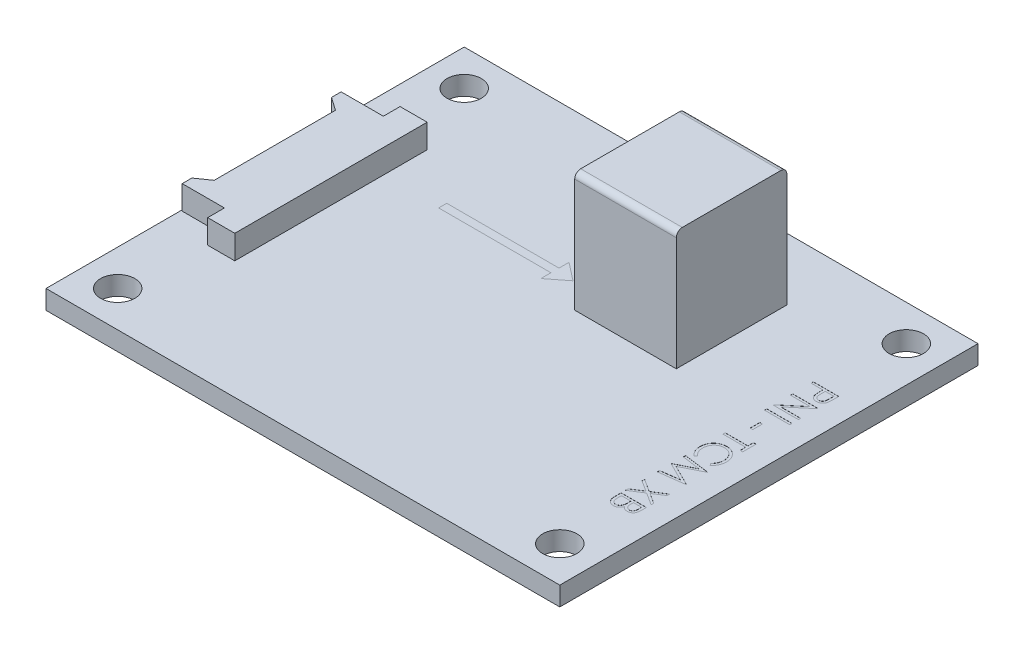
from build123d import *

# Parameters (mm, degrees)
SKETCH1_W           = 43
SKETCH1_H           = 35
SKETCH1_R           = 1.435
BOSS_EXTRUDE1_DEPTH = 1.588
SKETCH7_W           = 8.5
SKETCH7_H           = 9.25
BOSS_EXTRUDE4_DEPTH = 10
FILLET1_R           = 0.5
BOSS_EXTRUDE5_DEPTH = 2
SKETCH8_W           = 2.116666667
SKETCH8_H           = 0.189957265
SKETCH8_W_2         = 0.217094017
SKETCH8_H_2         = 0.814102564
CUT_EXTRUDE2_DEPTH  = 0.01


with BuildPart() as part:
    # Sketch1 → Boss-Extrude1 (new body)
    with BuildSketch(Plane(origin=(0, 0, 0), x_dir=(1, 0, 0), z_dir=(0, 1, 0))):
        Rectangle(SKETCH1_W, SKETCH1_H)
        with Locations(Location((-18.5, 14.5, 0), (0, 0, 270))):
            Circle(SKETCH1_R, mode=Mode.SUBTRACT)
        with Locations(Location((18.5, -14.5, 0), (0, 0, 270))):
            Circle(SKETCH1_R, mode=Mode.SUBTRACT)
        with Locations(Location((-18.5, -14.5, 0), (0, 0, 270))):
            Circle(SKETCH1_R, mode=Mode.SUBTRACT)
        with Locations(Location((18.5, 14.5, 0), (0, 0, 270))):
            Circle(SKETCH1_R, mode=Mode.SUBTRACT)
    extrude(amount=BOSS_EXTRUDE1_DEPTH)

    # Sketch7 → Boss-Extrude4 (add)
    with BuildSketch(Plane(origin=(0, 1.588, 0), x_dir=(1, 0, 0), z_dir=(0, 1, 0))):
        with Locations((6.45, 7.675)):
            Rectangle(SKETCH7_W, SKETCH7_H)
    extrude(amount=BOSS_EXTRUDE4_DEPTH)

    # Fillet1
    fillet1_edges = [part.edges().sort_by_distance(p)[0] for p in [
        (6.45, 11.588, -3.05),
        (6.45, 11.588, -12.3),
    ]]
    fillet(fillet1_edges, radius=FILLET1_R)

    # Sketch9 → Boss-Extrude5 (add)
    with BuildSketch(Plane(origin=(0, 1.588, 0), x_dir=(1, 0, 0), z_dir=(0, 1, 0))):
        Polygon((-15.6, 8.5), (-17.866849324, 8.5), (-17.866849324, 7.1), (-21.4, 7.1), (-21.4, 6.295102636), (-20.3, 5.524195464), (-20.3, -4.624195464), (-21.4, -5.395102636), (-21.4, -6.2), (-17.866849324, -6.2), (-17.866849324, -7.6), (-15.6, -7.6), align=None)
    extrude(amount=BOSS_EXTRUDE5_DEPTH)

    # Sketch8 → Cut-Extrude2 (cut)
    # profile 1 of 9: a face of its own
    with BuildSketch(Plane(origin=(0, 1.588, 0), x_dir=(1, 0, 0), z_dir=(0, 1, 0))):
        with BuildLine():
            Line((19.497367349, 7.842992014), (19.497367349, 7.427884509))
            add(Edge.make_bspline(
                [(19.497367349, 7.427884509), (19.497335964, 7.399333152), (19.497275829, 7.344627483), (19.495452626, 7.266180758), (19.493017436, 7.194933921), (19.489641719, 7.131040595), (19.485652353, 7.074304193), (19.480057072, 7.024981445), (19.474214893, 6.982684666), (19.468275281, 6.957341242), (19.465566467, 6.945783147)],
                knots=[0, 0, 0, 0, 1.415646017, 2.712440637, 3.8905458, 4.950247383, 5.884950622, 6.709939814, 7.411656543, 8, 8, 8, 8], degree=3))
            add(Edge.make_bspline(
                [(19.465566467, 6.945783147), (19.4615618, 6.931151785), (19.45364683, 6.90223383), (19.437793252, 6.860565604), (19.418997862, 6.82091928), (19.397567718, 6.78316991), (19.372626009, 6.747740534), (19.344961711, 6.714177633), (19.314590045, 6.682288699), (19.280922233, 6.65315699), (19.245199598, 6.626337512), (19.206626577, 6.603330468), (19.166042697, 6.583869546), (19.123032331, 6.567975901), (19.077856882, 6.555890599), (19.030384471, 6.546961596), (18.980778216, 6.54124871), (18.946874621, 6.540704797), (18.929615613, 6.540427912)],
                knots=[0, 0, 0, 0, 0.999487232, 1.975422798, 2.933948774, 3.889618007, 4.832992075, 5.786114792, 6.754729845, 7.731954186, 8.717668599, 9.695514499, 10.68728626, 11.680675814, 12.71351902, 13.766008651, 14.862761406, 16, 16, 16, 16], degree=3))
            add(Edge.make_bspline(
                [(18.929615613, 6.540427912), (18.912211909, 6.540682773), (18.878160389, 6.541181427), (18.828344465, 6.547166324), (18.780738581, 6.555227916), (18.735448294, 6.567623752), (18.692742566, 6.583858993), (18.651968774, 6.602904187), (18.613820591, 6.625875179), (18.578159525, 6.652269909), (18.544952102, 6.681632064), (18.514438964, 6.713837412), (18.486798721, 6.748755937), (18.461969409, 6.786276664), (18.440526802, 6.826765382), (18.421321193, 6.869608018), (18.405191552, 6.915176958), (18.396706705, 6.946710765), (18.392392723, 6.962743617)],
                knots=[0, 0, 0, 0, 1.121902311, 2.195077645, 3.232258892, 4.234102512, 5.217864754, 6.176164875, 7.132989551, 8.084763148, 9.034132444, 9.988522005, 10.94243251, 11.903244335, 12.886203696, 13.894208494, 14.929344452, 16, 16, 16, 16], degree=3))
            add(Edge.make_bspline(
                [(18.392392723, 6.962743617), (18.389572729, 6.976004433), (18.38339255, 7.005066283), (18.37649315, 7.052928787), (18.37060422, 7.108654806), (18.36618877, 7.17216828), (18.362408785, 7.243412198), (18.359404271, 7.322425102), (18.35775336, 7.409362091), (18.357668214, 7.47000232), (18.357623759, 7.501662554)],
                knots=[0, 0, 0, 0, 0.601384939, 1.31797006, 2.144135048, 3.087295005, 4.142315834, 5.309527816, 6.595305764, 8, 8, 8, 8], degree=3))
            Line((18.357623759, 7.501662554), (18.357623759, 7.653034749))
            Line((18.357623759, 7.653034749), (17.380700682, 7.653034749))
            Line((17.380700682, 7.653034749), (17.380700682, 7.842992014))
            Line((17.380700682, 7.842992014), (19.497367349, 7.842992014))
        make_face()
        with BuildLine():
            Line((19.280273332, 7.653034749), (18.574717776, 7.653034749))
            Line((18.574717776, 7.653034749), (18.570053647, 7.282448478))
            add(Edge.make_bspline(
                [(18.570053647, 7.282448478), (18.570042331, 7.26435387), (18.570020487, 7.229422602), (18.572463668, 7.178824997), (18.57515866, 7.132002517), (18.579379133, 7.08885348), (18.584940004, 7.049707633), (18.590992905, 7.014062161), (18.599193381, 6.982438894), (18.610627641, 6.945382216), (18.629748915, 6.904229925), (18.658219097, 6.859757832), (18.69351304, 6.821458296), (18.733740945, 6.788536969), (18.778655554, 6.763023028), (18.826334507, 6.743833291), (18.876807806, 6.73265538), (18.911329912, 6.731147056), (18.928767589, 6.730385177)],
                knots=[0, 0, 0, 0, 1.160368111, 2.240066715, 3.248291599, 4.168343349, 5.019594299, 5.784185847, 6.485545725, 7.113397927, 8.269509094, 9.383373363, 10.487084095, 11.595623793, 12.704274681, 13.786671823, 14.88201193, 16, 16, 16, 16], degree=3))
            add(Edge.make_bspline(
                [(18.928767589, 6.730385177), (18.945783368, 6.731151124), (18.97960863, 6.732673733), (19.029205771, 6.743921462), (19.076378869, 6.762985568), (19.120740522, 6.788709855), (19.160803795, 6.820685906), (19.195301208, 6.858136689), (19.223410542, 6.900297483), (19.241428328, 6.939536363), (19.252447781, 6.974368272), (19.260154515, 7.004626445), (19.266308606, 7.038789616), (19.271291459, 7.076870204), (19.27555715, 7.118572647), (19.278451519, 7.164255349), (19.280145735, 7.213745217), (19.28022977, 7.248102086), (19.280273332, 7.26591202)],
                knots=[0, 0, 0, 0, 1.120550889, 2.227516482, 3.330715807, 4.461473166, 5.594337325, 6.694900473, 7.802844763, 8.919519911, 9.52614448, 10.208195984, 10.975273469, 11.811520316, 12.738076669, 13.736566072, 14.826679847, 16, 16, 16, 16], degree=3))
            Line((19.280273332, 7.26591202), (19.280273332, 7.653034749))
        make_face(mode=Mode.SUBTRACT)
    # profile 2 of 9: a face of its own
    with BuildSketch(Plane(origin=(0, 1.588, 0), x_dir=(1, 0, 0), z_dir=(0, 1, 0))):
        Polygon((17.380700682, 6.106239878), (19.497367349, 6.106239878), (19.497367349, 6.066382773), (17.831425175, 4.667992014), (19.497367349, 4.667992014), (19.497367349, 4.478034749), (17.380700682, 4.478034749), (17.380700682, 4.521283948), (19.04282675, 5.916282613), (17.380700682, 5.916282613), align=None)
    # profile 3 of 9: a face of its own
    with BuildSketch(Plane(origin=(0, 1.588, 0), x_dir=(1, 0, 0), z_dir=(0, 1, 0))):
        with Locations((18.439034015, 3.840321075)):
            Rectangle(SKETCH8_W, SKETCH8_H)
    # profile 4 of 9: a face of its own
    with BuildSketch(Plane(origin=(0, 1.588, 0), x_dir=(1, 0, 0), z_dir=(0, 1, 0))):
        with Locations((18.194803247, 2.252821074)):
            Rectangle(SKETCH8_W_2, SKETCH8_H_2)
    # profile 5 of 9: a face of its own
    with BuildSketch(Plane(origin=(0, 1.588, 0), x_dir=(1, 0, 0), z_dir=(0, 1, 0))):
        Polygon((19.280273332, 0.92312022), (19.497367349, 0.92312022), (19.497367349, -0.189486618), (19.280273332, -0.189486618), (19.280273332, 0.271838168), (17.380700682, 0.271838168), (17.380700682, 0.461795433), (19.280273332, 0.461795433), align=None)
    # profile 6 of 9: a face of its own
    with BuildSketch(Plane(origin=(0, 1.588, 0), x_dir=(1, 0, 0), z_dir=(0, 1, 0))):
        with BuildLine():
            Line((19.108972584, -2.523247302), (18.981769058, -2.357034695))
            add(Edge.make_bspline(
                [(18.981769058, -2.357034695), (18.995899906, -2.345177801), (19.023971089, -2.321623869), (19.063389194, -2.28372997), (19.100319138, -2.244238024), (19.134936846, -2.203163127), (19.166031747, -2.159765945), (19.195224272, -2.115097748), (19.221390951, -2.068411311), (19.253118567, -2.003851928), (19.286226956, -1.91939823), (19.313987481, -1.813084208), (19.331659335, -1.702103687), (19.333573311, -1.626388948), (19.334546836, -1.587877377)],
                knots=[0, 0, 0, 0, 0.757959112, 1.505699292, 2.245454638, 2.979532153, 3.711538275, 4.438200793, 5.171680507, 5.909471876, 7.393775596, 8.890124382, 10.418191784, 12, 12, 12, 12], degree=3))
            add(Edge.make_bspline(
                [(19.334546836, -1.587877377), (19.334301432, -1.566660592), (19.333812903, -1.524423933), (19.327413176, -1.461737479), (19.318314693, -1.400102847), (19.305142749, -1.339749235), (19.287994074, -1.280796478), (19.267883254, -1.222795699), (19.242857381, -1.166429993), (19.215219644, -1.111021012), (19.183994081, -1.05793794), (19.149945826, -1.007701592), (19.113409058, -0.960541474), (19.074478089, -0.916326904), (19.032669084, -0.87554279), (18.988473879, -0.837535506), (18.941360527, -0.802990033), (18.892212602, -0.771057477), (18.840957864, -0.742643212), (18.787918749, -0.71810612), (18.733298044, -0.697075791), (18.676983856, -0.680280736), (18.619197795, -0.667033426), (18.559817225, -0.657881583), (18.498957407, -0.651539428), (18.457707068, -0.651055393), (18.436913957, -0.650811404)],
                knots=[0, 0, 0, 0, 1.055000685, 2.100209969, 3.131349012, 4.153242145, 5.170189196, 6.184191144, 7.204341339, 8.235672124, 9.263040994, 10.265373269, 11.252624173, 12.22887325, 13.193405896, 14.155809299, 15.126090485, 16.097288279, 17.069732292, 18.038585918, 19.002221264, 19.978698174, 20.959418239, 21.948869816, 22.966084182, 24, 24, 24, 24], degree=3))
            add(Edge.make_bspline(
                [(18.436913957, -0.650811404), (18.405628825, -0.651574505), (18.344204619, -0.65307275), (18.254233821, -0.666406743), (18.168042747, -0.686669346), (18.086170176, -0.717037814), (18.00760655, -0.754484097), (17.933681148, -0.801801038), (17.863276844, -0.856602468), (17.798057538, -0.919663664), (17.73848019, -0.988851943), (17.686016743, -1.063085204), (17.642283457, -1.142178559), (17.605891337, -1.225258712), (17.57791703, -1.31296498), (17.558223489, -1.405139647), (17.545377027, -1.501582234), (17.54414713, -1.567482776), (17.543521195, -1.601021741)],
                knots=[0, 0, 0, 0, 1.029171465, 2.020641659, 2.987623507, 3.938342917, 4.889210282, 5.84687017, 6.821220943, 7.821438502, 8.827599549, 9.822697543, 10.807740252, 11.797342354, 12.80366471, 13.83203677, 14.896651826, 16, 16, 16, 16], degree=3))
            add(Edge.make_bspline(
                [(17.543521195, -1.601021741), (17.544542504, -1.63797432), (17.546552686, -1.710705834), (17.563582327, -1.817366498), (17.591194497, -1.919471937), (17.629837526, -2.017027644), (17.680072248, -2.109758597), (17.740970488, -2.19780991), (17.813111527, -2.281255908), (17.868195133, -2.331433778), (17.896298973, -2.357034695)],
                knots=[0, 0, 0, 0, 1.028121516, 2.023589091, 2.998037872, 3.967518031, 4.937445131, 5.927275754, 6.942489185, 8, 8, 8, 8], degree=3))
            Line((17.896298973, -2.357034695), (17.770367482, -2.523247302))
            add(Edge.make_bspline(
                [(17.770367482, -2.523247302), (17.753108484, -2.509871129), (17.718673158, -2.483182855), (17.670128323, -2.439967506), (17.624464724, -2.394443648), (17.582060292, -2.346267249), (17.54202979, -2.296014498), (17.505715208, -2.24280022), (17.472010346, -2.187543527), (17.441556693, -2.129922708), (17.414251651, -2.070126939), (17.391199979, -2.008218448), (17.371057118, -1.944721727), (17.354595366, -1.8796048), (17.341726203, -1.812650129), (17.333128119, -1.744087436), (17.327236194, -1.673771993), (17.326699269, -1.626333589), (17.326427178, -1.602293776)],
                knots=[0, 0, 0, 0, 0.986756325, 1.968786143, 2.935506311, 3.899499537, 4.868307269, 5.8376204, 6.809456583, 7.792545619, 8.781780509, 9.778496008, 10.776623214, 11.79151764, 12.812666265, 13.856269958, 14.913646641, 16, 16, 16, 16], degree=3))
            add(Edge.make_bspline(
                [(17.326427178, -1.602293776), (17.326585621, -1.57952832), (17.326898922, -1.534512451), (17.331974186, -1.468049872), (17.33889855, -1.40334665), (17.349324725, -1.340587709), (17.361628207, -1.279430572), (17.378120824, -1.220429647), (17.396595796, -1.163004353), (17.418309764, -1.107385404), (17.442812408, -1.053525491), (17.470505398, -1.001598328), (17.501155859, -0.9516278), (17.534088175, -0.903122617), (17.570360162, -0.856799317), (17.609468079, -0.81225647), (17.651280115, -0.769244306), (17.681430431, -0.742633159), (17.696589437, -0.729253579)],
                knots=[0, 0, 0, 0, 1.114604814, 2.203992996, 3.262667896, 4.300477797, 5.318619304, 6.316056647, 7.298880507, 8.271930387, 9.238335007, 10.195173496, 11.151986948, 12.108099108, 13.064862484, 14.031167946, 15.010108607, 16, 16, 16, 16], degree=3))
            add(Edge.make_bspline(
                [(17.696589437, -0.729253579), (17.72292149, -0.707823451), (17.775267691, -0.66522192), (17.860107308, -0.61071734), (17.948685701, -0.564061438), (18.041468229, -0.526338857), (18.138246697, -0.496849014), (18.239069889, -0.476419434), (18.343843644, -0.46314394), (18.415106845, -0.461625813), (18.451330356, -0.460854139)],
                knots=[0, 0, 0, 0, 0.994628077, 1.977248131, 2.950237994, 3.925870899, 4.908910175, 5.911660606, 6.938484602, 8, 8, 8, 8], degree=3))
            add(Edge.make_bspline(
                [(18.451330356, -0.460854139), (18.489401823, -0.461798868), (18.564305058, -0.463657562), (18.674257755, -0.479318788), (18.77944863, -0.50481829), (18.880282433, -0.539931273), (18.97618223, -0.586254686), (19.067553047, -0.642332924), (19.154320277, -0.708713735), (19.235374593, -0.784563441), (19.30947975, -0.867763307), (19.374677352, -0.956854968), (19.428934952, -1.051671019), (19.47428981, -1.151165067), (19.509150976, -1.25608262), (19.533555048, -1.3661997), (19.548744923, -1.481309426), (19.550665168, -1.559845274), (19.551640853, -1.599749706)],
                knots=[0, 0, 0, 0, 1.032901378, 2.032168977, 3.007206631, 3.966850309, 4.924221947, 5.891988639, 6.871730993, 7.884084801, 8.900290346, 9.89161143, 10.874607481, 11.860025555, 12.854717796, 13.869097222, 14.917278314, 16, 16, 16, 16], degree=3))
            add(Edge.make_bspline(
                [(19.551640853, -1.599749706), (19.551349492, -1.624069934), (19.550772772, -1.672209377), (19.545141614, -1.743421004), (19.535771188, -1.812754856), (19.52293307, -1.880378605), (19.507197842, -1.94653747), (19.486599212, -2.010552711), (19.462679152, -2.072772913), (19.435832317, -2.133244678), (19.405140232, -2.191310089), (19.371805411, -2.24695858), (19.335058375, -2.299518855), (19.296113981, -2.349979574), (19.253515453, -2.397204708), (19.208650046, -2.442542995), (19.160186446, -2.484428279), (19.126075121, -2.510283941), (19.108972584, -2.523247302)],
                knots=[0, 0, 0, 0, 1.096705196, 2.170817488, 3.219277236, 4.250701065, 5.274195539, 6.284202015, 7.28098643, 8.279664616, 9.266225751, 10.241373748, 11.203306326, 12.157093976, 13.114198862, 14.069774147, 15.032234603, 16, 16, 16, 16], degree=3))
        make_face()
    # profile 7 of 9: a face of its own
    with BuildSketch(Plane(origin=(0, 1.588, 0), x_dir=(1, 0, 0), z_dir=(0, 1, 0))):
        Polygon((17.380700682, -2.848888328), (19.497367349, -3.128312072), (19.497367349, -3.155448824), (17.760615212, -4.029337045), (19.497367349, -4.901105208), (19.497367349, -4.928665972), (17.380700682, -5.209785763), (17.380700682, -5.018980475), (18.903750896, -4.816302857), (17.380700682, -4.05223368), (17.380700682, -4.009408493), (18.90714299, -3.242371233), (17.380700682, -3.040117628), align=None)
    # profile 8 of 9: a face of its own
    with BuildSketch(Plane(origin=(0, 1.588, 0), x_dir=(1, 0, 0), z_dir=(0, 1, 0))):
        Polygon((19.497367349, -6.308824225), (19.497367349, -6.528038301), (18.631535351, -7.082221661), (19.497367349, -7.636405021), (19.497367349, -7.855619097), (18.460234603, -7.192040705), (17.380700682, -7.882755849), (17.380700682, -7.663541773), (18.288933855, -7.082221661), (17.380700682, -6.500901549), (17.380700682, -6.281687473), (18.460234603, -6.972826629), align=None)
    # profile 9 of 9: a face of its own
    with BuildSketch(Plane(origin=(0, 1.588, 0), x_dir=(1, 0, 0), z_dir=(0, 1, 0))):
        with BuildLine():
            Line((19.497367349, -8.249102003), (19.497367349, -8.662089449))
            add(Edge.make_bspline(
                [(19.497367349, -8.662089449), (19.497261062, -8.682305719), (19.497055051, -8.721489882), (19.493860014, -8.778470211), (19.489503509, -8.83183973), (19.482591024, -8.881613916), (19.474250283, -8.92776977), (19.464149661, -8.970446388), (19.452038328, -9.009508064), (19.43277891, -9.056142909), (19.404159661, -9.109313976), (19.361869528, -9.166886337), (19.310142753, -9.21611652), (19.251793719, -9.258562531), (19.187606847, -9.292308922), (19.119112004, -9.316722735), (19.047192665, -9.332179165), (18.997817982, -9.333768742), (18.972864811, -9.334572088)],
                knots=[0, 0, 0, 0, 1.001505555, 1.941167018, 2.826882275, 3.653841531, 4.429895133, 5.150066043, 5.825578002, 6.45369114, 7.647487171, 8.808567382, 9.977351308, 11.170798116, 12.373658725, 13.556498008, 14.765093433, 16, 16, 16, 16], degree=3))
            add(Edge.make_bspline(
                [(18.972864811, -9.334572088), (18.949485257, -9.333923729), (18.903542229, -9.332649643), (18.836453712, -9.320051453), (18.772328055, -9.301294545), (18.711955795, -9.274065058), (18.656112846, -9.23903951), (18.60513108, -9.196890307), (18.560245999, -9.14670617), (18.535257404, -9.109046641), (18.522564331, -9.089917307)],
                knots=[0, 0, 0, 0, 1.044266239, 2.052081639, 3.041743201, 4.026043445, 5.00270663, 5.980942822, 6.97441044, 8, 8, 8, 8], degree=3))
            add(Edge.make_bspline(
                [(18.522564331, -9.089917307), (18.513339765, -9.113966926), (18.495690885, -9.159979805), (18.464318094, -9.223345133), (18.430580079, -9.278157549), (18.39354147, -9.324477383), (18.353118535, -9.363494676), (18.31012072, -9.398533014), (18.262431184, -9.427887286), (18.211407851, -9.45310508), (18.157408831, -9.47295122), (18.100681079, -9.486993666), (18.041858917, -9.495622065), (18.001765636, -9.496798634), (17.981525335, -9.497392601)],
                knots=[0, 0, 0, 0, 1.272302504, 2.434229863, 3.488457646, 4.447234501, 5.35599188, 6.26022912, 7.18267843, 8.11661068, 9.06895546, 10.019249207, 11.000057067, 12, 12, 12, 12], degree=3))
            add(Edge.make_bspline(
                [(17.981525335, -9.497392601), (17.960862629, -9.496801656), (17.920208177, -9.495638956), (17.860483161, -9.487066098), (17.803414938, -9.472536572), (17.748597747, -9.45257221), (17.696341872, -9.426368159), (17.645992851, -9.395165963), (17.598891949, -9.357188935), (17.553919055, -9.314858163), (17.513506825, -9.266914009), (17.477528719, -9.215193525), (17.447804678, -9.1589528), (17.423147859, -9.099063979), (17.404038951, -9.035129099), (17.390772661, -8.967385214), (17.381813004, -8.895817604), (17.381077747, -8.846704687), (17.380700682, -8.821517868)],
                knots=[0, 0, 0, 0, 0.978404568, 1.925038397, 2.85041836, 3.763147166, 4.682162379, 5.614488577, 6.562659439, 7.54271123, 8.535210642, 9.526693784, 10.520907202, 11.541451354, 12.589717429, 13.675358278, 14.807842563, 16, 16, 16, 16], degree=3))
            Line((17.380700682, -8.821517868), (17.380700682, -8.249102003))
            Line((17.380700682, -8.249102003), (19.497367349, -8.249102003))
        make_face()
        with BuildLine():
            Line((19.280273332, -8.439059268), (18.601854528, -8.439059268))
            Line((18.601854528, -8.439059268), (18.601854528, -8.566686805))
            add(Edge.make_bspline(
                [(18.601854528, -8.566686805), (18.602094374, -8.585343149), (18.602557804, -8.621391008), (18.603927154, -8.673732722), (18.607593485, -8.72219672), (18.611471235, -8.766949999), (18.617442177, -8.807692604), (18.624748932, -8.844560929), (18.632408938, -8.877886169), (18.645472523, -8.916300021), (18.66458338, -8.95986082), (18.694939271, -9.006003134), (18.730113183, -9.047341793), (18.771447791, -9.081859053), (18.816576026, -9.110341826), (18.865501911, -9.129349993), (18.916315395, -9.142832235), (18.951290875, -9.144014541), (18.969048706, -9.144614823)],
                knots=[0, 0, 0, 0, 1.156481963, 2.23455883, 3.244418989, 4.168404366, 5.01828131, 5.794834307, 6.498111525, 7.13526334, 8.307595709, 9.435046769, 10.546766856, 11.659452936, 12.760769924, 13.837671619, 14.902137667, 16, 16, 16, 16], degree=3))
            add(Edge.make_bspline(
                [(18.969048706, -9.144614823), (18.980802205, -9.144314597), (19.003857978, -9.143725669), (19.037338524, -9.138365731), (19.069229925, -9.130588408), (19.098798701, -9.118437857), (19.126885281, -9.10374533), (19.152242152, -9.084633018), (19.176258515, -9.063048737), (19.198052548, -9.037700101), (19.217580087, -9.008709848), (19.234762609, -8.975801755), (19.248316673, -8.938582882), (19.260475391, -8.897897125), (19.268912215, -8.853093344), (19.275966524, -8.804609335), (19.279552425, -8.752033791), (19.280027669, -8.715660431), (19.280273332, -8.696858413)],
                knots=[0, 0, 0, 0, 0.911752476, 1.788502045, 2.626783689, 3.45400582, 4.26402138, 5.080402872, 5.911472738, 6.767166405, 7.66795952, 8.620018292, 9.640966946, 10.73819047, 11.913090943, 13.176185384, 14.540321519, 16, 16, 16, 16], degree=3))
            Line((19.280273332, -8.696858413), (19.280273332, -8.439059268))
        make_face(mode=Mode.SUBTRACT)
        with BuildLine():
            Line((18.384760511, -8.439059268), (17.597794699, -8.439059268))
            Line((17.597794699, -8.439059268), (17.597794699, -8.709578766))
            add(Edge.make_bspline(
                [(17.597794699, -8.709578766), (17.598025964, -8.728942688), (17.598471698, -8.766264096), (17.599942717, -8.820147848), (17.603218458, -8.869955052), (17.608558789, -8.915714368), (17.614107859, -8.957828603), (17.62178804, -8.995879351), (17.630519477, -9.029924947), (17.644031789, -9.069396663), (17.664987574, -9.113872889), (17.696790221, -9.161769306), (17.734179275, -9.204778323), (17.777997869, -9.240882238), (17.825282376, -9.270695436), (17.875785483, -9.291605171), (17.927966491, -9.305049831), (17.963636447, -9.306638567), (17.981525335, -9.307435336)],
                knots=[0, 0, 0, 0, 1.159821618, 2.235403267, 3.228114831, 4.14795534, 4.994323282, 5.771256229, 6.471395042, 7.097801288, 8.267864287, 9.404187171, 10.531774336, 11.667624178, 12.792825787, 13.866573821, 14.930062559, 16, 16, 16, 16], degree=3))
            add(Edge.make_bspline(
                [(17.981525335, -9.307435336), (17.99271085, -9.307272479), (18.014901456, -9.306949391), (18.047486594, -9.301893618), (18.079191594, -9.294840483), (18.10953703, -9.284626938), (18.139016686, -9.271748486), (18.167117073, -9.255586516), (18.194510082, -9.236922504), (18.229101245, -9.207725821), (18.268969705, -9.165298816), (18.307998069, -9.1049965), (18.339475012, -9.036434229), (18.352839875, -8.986706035), (18.359743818, -8.961017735)],
                knots=[0, 0, 0, 0, 0.723503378, 1.435336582, 2.130201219, 2.824764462, 3.504949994, 4.209866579, 4.920640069, 5.648298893, 7.13757748, 8.670694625, 10.280166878, 12, 12, 12, 12], degree=3))
            add(Edge.make_bspline(
                [(18.359743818, -8.961017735), (18.361833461, -8.950719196), (18.36636424, -8.928389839), (18.371143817, -8.891978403), (18.375431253, -8.85027018), (18.378519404, -8.803443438), (18.381834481, -8.751311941), (18.383077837, -8.693892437), (18.384595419, -8.631144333), (18.384704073, -8.587606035), (18.384760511, -8.564990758)],
                knots=[0, 0, 0, 0, 0.634452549, 1.375623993, 2.216454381, 3.166361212, 4.209414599, 5.370755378, 6.634280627, 8, 8, 8, 8], degree=3))
            Line((18.384760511, -8.564990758), (18.384760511, -8.439059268))
        make_face(mode=Mode.SUBTRACT)
    extrude(amount=-CUT_EXTRUDE2_DEPTH, mode=Mode.SUBTRACT)


solid = part.part
